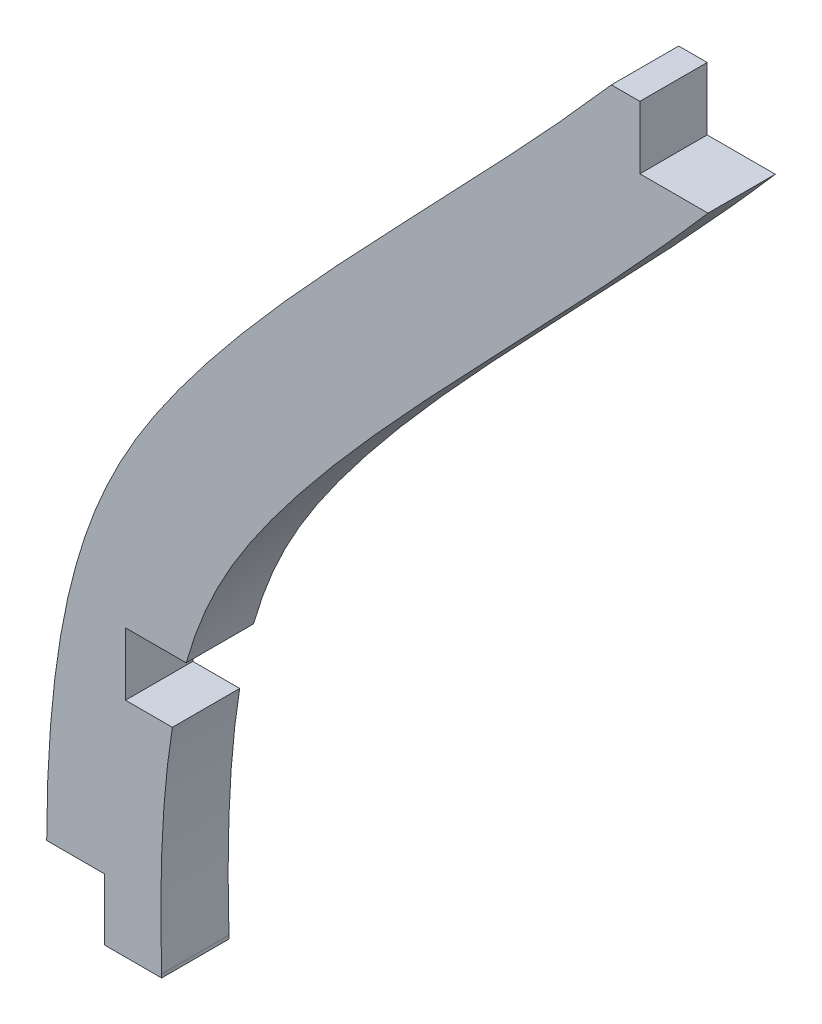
from build123d import *

# Parameters (mm, degrees)
BOSS_EXTRUDE1_DEPTH = 2.9972
SKETCH3_W           = 5.368248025
SKETCH3_H           = 2.794
SKETCH3_W_2         = 2.921266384
SKETCH3_H_2         = 2.7432
CUT_EXTRUDE1_DEPTH  = 2.9972
SKETCH4_W           = 38.093325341
SKETCH4_H           = 70.332301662
CUT_EXTRUDE2_DEPTH  = 7.62


with BuildPart() as part:
    # Sketch2 → Boss-Extrude1 (new body)
    with BuildSketch(Plane.XY):
        with BuildLine():
            Line((-71.122282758, 0.152274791), (-71.122282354, 0))
            Line((-71.122282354, 0), (-76.2, 0))
            add(Edge.make_bspline(
                [(-76.2, 0), (-76.569654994, 12.326423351), (-70.425353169, 26.763478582), (-35.694986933, 54.959288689), (-31.122332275, 88.312292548), (-28.575, 106.68)],
                knots=[0, 0, 0, 0, 0.192928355, 0.526146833, 1, 1, 1, 1], degree=3))
            Line((-28.575, 106.68), (-23.543159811, 106.68))
            Line((-23.543159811, 106.68), (-23.543159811, 105.98215739))
            add(Edge.make_bspline(
                [(-71.122282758, 0.152274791), (-71.136070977, 0.612053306), (-71.156705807, 1.549793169), (-71.164598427, 3.28211812), (-71.116797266, 5.286174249), (-70.973071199, 7.421615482), (-70.676706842, 9.95097976), (-70.130555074, 12.571826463), (-69.245381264, 15.104636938), (-68.120237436, 17.334393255), (-66.672184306, 19.551075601), (-64.863064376, 21.934930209), (-62.11843264, 25.208242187), (-58.137191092, 29.502846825), (-52.85973139, 34.964227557), (-47.448209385, 40.791541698), (-42.251514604, 47.060450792), (-37.691832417, 53.925317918), (-34.064233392, 61.084345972), (-31.169794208, 68.465794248), (-28.900123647, 75.982476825), (-27.122712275, 83.563137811), (-25.715420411, 91.141122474), (-24.75221092, 97.394015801), (-24.048588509, 102.335722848), (-23.712246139, 104.76294926), (-23.543159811, 105.98215739)],
                knots=[0, 0, 0, 0, 0.0078125, 0.015625, 0.03125, 0.046875, 0.0625, 0.09375, 0.125, 0.15625, 0.1875, 0.21875, 0.25, 0.3125, 0.375, 0.4375, 0.5, 0.5625, 0.625, 0.6875, 0.75, 0.8125, 0.875, 0.9375, 0.96875, 1, 1, 1, 1], degree=3))
        make_face()
    extrude(amount=BOSS_EXTRUDE1_DEPTH)

    # Sketch3 → Cut-Extrude1 (cut)
    with BuildSketch(Plane.XY.offset(2.9972)):
        Polygon((-73.66, 0), (-73.66, 2.7432), (-76.239147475, 2.7432), (-76.567195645, 0), align=None)
        Polygon((-70.028476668, 12.7), (-72.729966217, 12.7), (-72.729966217, 9.906), (-70.643031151, 9.906), align=None)
        with Locations((-47.143507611, 43.053)):
            Rectangle(SKETCH3_W, SKETCH3_H)
        with Locations((-27.495633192, 105.3084)):
            Rectangle(SKETCH3_W_2, SKETCH3_H_2)
    extrude(amount=-CUT_EXTRUDE1_DEPTH, mode=Mode.SUBTRACT)

    # Sketch4 → Cut-Extrude2 (cut)
    with BuildSketch(Plane.XY.offset(2.9972)):
        with Locations((-33.124922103, 79.616150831)):
            Rectangle(SKETCH4_W, SKETCH4_H)
    extrude(amount=-CUT_EXTRUDE2_DEPTH, mode=Mode.SUBTRACT)


solid = part.part
